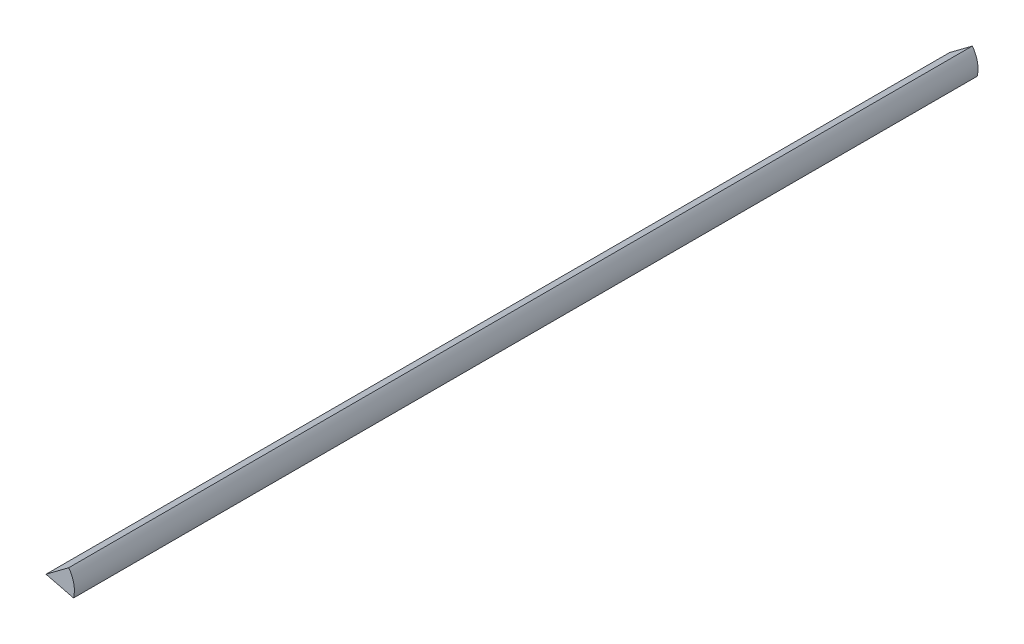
ISO-10303-21;
HEADER;
FILE_DESCRIPTION(('STEP AP214'),'2;1');
FILE_NAME('part.step','',(''),(''),'','','');
FILE_SCHEMA(('AUTOMOTIVE_DESIGN { 1 0 10303 214 1 1 1 1 }'));
ENDSEC;
DATA;
#1=APPLICATION_CONTEXT('core data for automotive mechanical design processes');
#2=APPLICATION_PROTOCOL_DEFINITION('international standard','automotive_design',2000,#1);
#3=PRODUCT_CONTEXT('',#1,'mechanical');
#4=PRODUCT('Part','Part','',(#3));
#5=PRODUCT_RELATED_PRODUCT_CATEGORY('part','',(#4));
#6=PRODUCT_DEFINITION_FORMATION('','',#4);
#7=PRODUCT_DEFINITION_CONTEXT('part definition',#1,'design');
#8=PRODUCT_DEFINITION('design','',#6,#7);
#9=PRODUCT_DEFINITION_SHAPE('','',#8);
#10=(LENGTH_UNIT() NAMED_UNIT(*) SI_UNIT(.MILLI.,.METRE.));
#11=(NAMED_UNIT(*) PLANE_ANGLE_UNIT() SI_UNIT($,.RADIAN.));
#12=(NAMED_UNIT(*) SI_UNIT($,.STERADIAN.) SOLID_ANGLE_UNIT());
#13=UNCERTAINTY_MEASURE_WITH_UNIT(LENGTH_MEASURE(1.E-05),#10,'distance_accuracy_value','');
#14=(GEOMETRIC_REPRESENTATION_CONTEXT(3) GLOBAL_UNCERTAINTY_ASSIGNED_CONTEXT((#13)) GLOBAL_UNIT_ASSIGNED_CONTEXT((#10,
#11,#12)) REPRESENTATION_CONTEXT('',''));
#15=CARTESIAN_POINT('',(0.,0.,0.));
#16=DIRECTION('',(0.,0.,1.));
#17=DIRECTION('',(1.,0.,0.));
#18=AXIS2_PLACEMENT_3D('',#15,#16,#17);
#19=CARTESIAN_POINT('',(140.756251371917,-2478.56661901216,-1212.85000000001));
#20=DIRECTION('',(0.,0.,1.));
#21=DIRECTION('',(1.,0.,0.));
#22=AXIS2_PLACEMENT_3D('',#19,#20,#21);
#23=CYLINDRICAL_SURFACE('',#22,38.0999999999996);
#24=CARTESIAN_POINT('',(140.756251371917,-2478.56661901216,0.));
#25=DIRECTION('',(0.,0.,1.));
#26=DIRECTION('',(-1.,0.,0.));
#27=AXIS2_PLACEMENT_3D('',#24,#25,#26);
#28=CIRCLE('',#27,38.0999999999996);
#29=CARTESIAN_POINT('',(177.746009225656,-2487.6972166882,0.));
#30=VERTEX_POINT('',#29);
#31=CARTESIAN_POINT('',(171.26221705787,-2455.74128095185,0.));
#32=VERTEX_POINT('',#31);
#33=EDGE_CURVE('E86',#30,#32,#28,.T.);
#34=ORIENTED_EDGE('',*,*,#33,.F.);
#35=DIRECTION('',(0.,0.,1.));
#36=VECTOR('',#35,1.);
#37=CARTESIAN_POINT('',(177.746009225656,-2487.6972166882,-1212.85000000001));
#38=LINE('',#37,#36);
#39=CARTESIAN_POINT('',(177.746009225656,-2487.6972166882,-1212.85000000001));
#40=VERTEX_POINT('',#39);
#41=EDGE_CURVE('E11',#40,#30,#38,.T.);
#42=ORIENTED_EDGE('',*,*,#41,.F.);
#43=CARTESIAN_POINT('',(140.756251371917,-2478.56661901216,-1212.85000000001));
#44=DIRECTION('',(0.,0.,1.));
#45=DIRECTION('',(-1.,0.,0.));
#46=AXIS2_PLACEMENT_3D('',#43,#44,#45);
#47=CIRCLE('',#46,38.0999999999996);
#48=CARTESIAN_POINT('',(171.26221705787,-2455.74128095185,-1212.85000000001));
#49=VERTEX_POINT('',#48);
#50=EDGE_CURVE('E78',#40,#49,#47,.T.);
#51=ORIENTED_EDGE('',*,*,#50,.T.);
#52=DIRECTION('',(0.,0.,1.));
#53=VECTOR('',#52,1.);
#54=CARTESIAN_POINT('',(171.26221705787,-2455.74128095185,-1212.85000000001));
#55=LINE('',#54,#53);
#56=EDGE_CURVE('E37',#49,#32,#55,.T.);
#57=ORIENTED_EDGE('',*,*,#56,.T.);
#58=EDGE_LOOP('',(#34,#42,#51,#57));
#59=FACE_BOUND('',#58,.T.);
#60=ADVANCED_FACE('F34',(#59),#23,.T.);
#61=CARTESIAN_POINT('',(140.756251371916,-2478.56661901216,-1212.85000000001));
#62=DIRECTION('',(-0.239648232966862,-0.970859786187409,0.));
#63=DIRECTION('',(0.970859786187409,-0.239648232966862,0.));
#64=AXIS2_PLACEMENT_3D('',#61,#62,#63);
#65=PLANE('',#64);
#66=DIRECTION('',(0.970859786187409,-0.239648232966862,0.));
#67=VECTOR('',#66,1.);
#68=CARTESIAN_POINT('',(140.756251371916,-2478.56661901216,0.));
#69=LINE('',#68,#67);
#70=CARTESIAN_POINT('',(140.756251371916,-2478.56661901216,0.));
#71=VERTEX_POINT('',#70);
#72=EDGE_CURVE('E80',#71,#30,#69,.T.);
#73=ORIENTED_EDGE('',*,*,#72,.F.);
#74=DIRECTION('',(0.,0.,1.));
#75=VECTOR('',#74,1.);
#76=CARTESIAN_POINT('',(140.756251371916,-2478.56661901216,-1212.85000000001));
#77=LINE('',#76,#75);
#78=CARTESIAN_POINT('',(140.756251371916,-2478.56661901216,-1212.85000000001));
#79=VERTEX_POINT('',#78);
#80=EDGE_CURVE('E43',#79,#71,#77,.T.);
#81=ORIENTED_EDGE('',*,*,#80,.F.);
#82=DIRECTION('',(0.970859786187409,-0.239648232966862,0.));
#83=VECTOR('',#82,1.);
#84=CARTESIAN_POINT('',(140.756251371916,-2478.56661901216,-1212.85000000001));
#85=LINE('',#84,#83);
#86=EDGE_CURVE('E75',#79,#40,#85,.T.);
#87=ORIENTED_EDGE('',*,*,#86,.T.);
#88=ORIENTED_EDGE('',*,*,#41,.T.);
#89=EDGE_LOOP('',(#73,#81,#87,#88));
#90=FACE_BOUND('',#89,.T.);
#91=ADVANCED_FACE('F90',(#90),#65,.T.);
#92=CARTESIAN_POINT('',(171.26221705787,-2455.74128095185,-1212.85000000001));
#93=DIRECTION('',(-0.599090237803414,0.800681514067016,0.));
#94=DIRECTION('',(-0.800681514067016,-0.599090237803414,0.));
#95=AXIS2_PLACEMENT_3D('',#92,#93,#94);
#96=PLANE('',#95);
#97=DIRECTION('',(-0.800681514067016,-0.599090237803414,0.));
#98=VECTOR('',#97,1.);
#99=CARTESIAN_POINT('',(171.26221705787,-2455.74128095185,0.));
#100=LINE('',#99,#98);
#101=EDGE_CURVE('E73',#32,#71,#100,.T.);
#102=ORIENTED_EDGE('',*,*,#101,.F.);
#103=ORIENTED_EDGE('',*,*,#56,.F.);
#104=DIRECTION('',(-0.800681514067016,-0.599090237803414,0.));
#105=VECTOR('',#104,1.);
#106=CARTESIAN_POINT('',(171.26221705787,-2455.74128095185,-1212.85000000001));
#107=LINE('',#106,#105);
#108=EDGE_CURVE('E71',#49,#79,#107,.T.);
#109=ORIENTED_EDGE('',*,*,#108,.T.);
#110=ORIENTED_EDGE('',*,*,#80,.T.);
#111=EDGE_LOOP('',(#102,#103,#109,#110));
#112=FACE_BOUND('',#111,.T.);
#113=ADVANCED_FACE('F70',(#112),#96,.T.);
#114=CARTESIAN_POINT('',(140.756251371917,-2478.56661901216,-1212.85000000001));
#115=DIRECTION('',(0.,0.,-1.));
#116=DIRECTION('',(-1.,0.,0.));
#117=AXIS2_PLACEMENT_3D('',#114,#115,#116);
#118=PLANE('',#117);
#119=ORIENTED_EDGE('',*,*,#50,.F.);
#120=ORIENTED_EDGE('',*,*,#86,.F.);
#121=ORIENTED_EDGE('',*,*,#108,.F.);
#122=EDGE_LOOP('',(#119,#120,#121));
#123=FACE_BOUND('',#122,.T.);
#124=ADVANCED_FACE('F77',(#123),#118,.T.);
#125=CARTESIAN_POINT('',(140.756251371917,-2478.56661901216,0.));
#126=DIRECTION('',(0.,0.,-1.));
#127=DIRECTION('',(-1.,0.,0.));
#128=AXIS2_PLACEMENT_3D('',#125,#126,#127);
#129=PLANE('',#128);
#130=ORIENTED_EDGE('',*,*,#33,.T.);
#131=ORIENTED_EDGE('',*,*,#101,.T.);
#132=ORIENTED_EDGE('',*,*,#72,.T.);
#133=EDGE_LOOP('',(#130,#131,#132));
#134=FACE_BOUND('',#133,.T.);
#135=ADVANCED_FACE('F89',(#134),#129,.F.);
#136=CLOSED_SHELL('',(#60,#91,#113,#124,#135));
#137=MANIFOLD_SOLID_BREP('B2',#136);
#138=ADVANCED_BREP_SHAPE_REPRESENTATION('',(#18,#137),#14);
#139=SHAPE_DEFINITION_REPRESENTATION(#9,#138);
ENDSEC;
END-ISO-10303-21;
